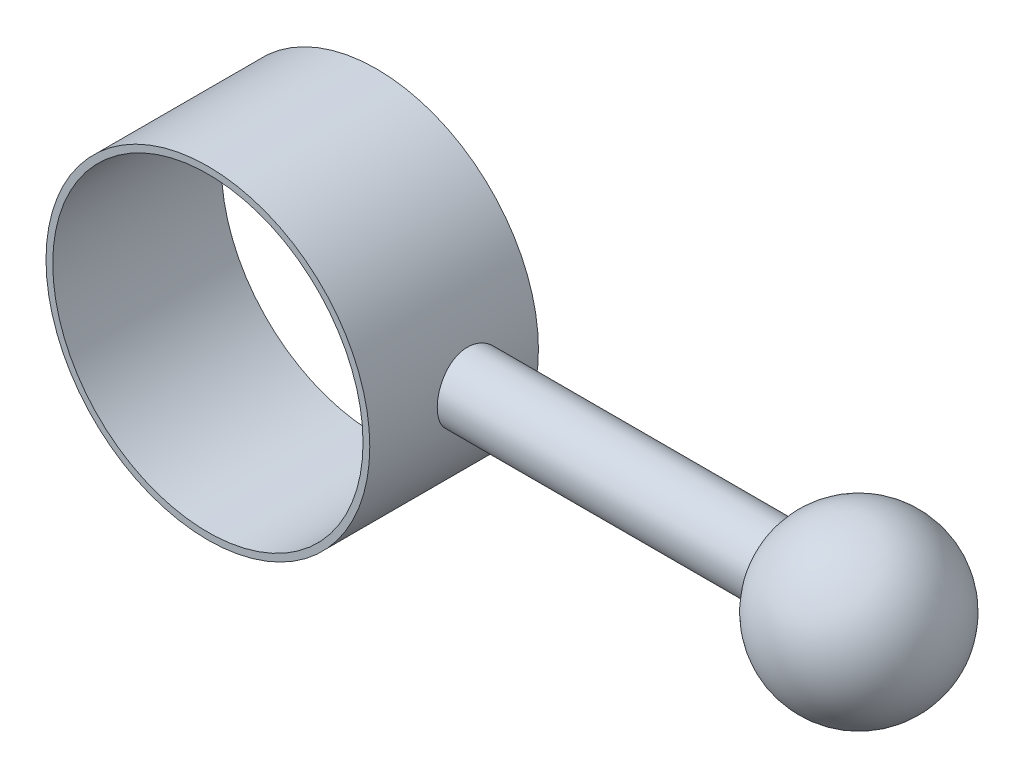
ISO-10303-21;
HEADER;
FILE_DESCRIPTION(('STEP AP214'),'2;1');
FILE_NAME('part.step','',(''),(''),'','','');
FILE_SCHEMA(('AUTOMOTIVE_DESIGN { 1 0 10303 214 1 1 1 1 }'));
ENDSEC;
DATA;
#1=APPLICATION_CONTEXT('core data for automotive mechanical design processes');
#2=APPLICATION_PROTOCOL_DEFINITION('international standard','automotive_design',2000,#1);
#3=PRODUCT_CONTEXT('',#1,'mechanical');
#4=PRODUCT('Part','Part','',(#3));
#5=PRODUCT_RELATED_PRODUCT_CATEGORY('part','',(#4));
#6=PRODUCT_DEFINITION_FORMATION('','',#4);
#7=PRODUCT_DEFINITION_CONTEXT('part definition',#1,'design');
#8=PRODUCT_DEFINITION('design','',#6,#7);
#9=PRODUCT_DEFINITION_SHAPE('','',#8);
#10=(LENGTH_UNIT() NAMED_UNIT(*) SI_UNIT(.MILLI.,.METRE.));
#11=(NAMED_UNIT(*) PLANE_ANGLE_UNIT() SI_UNIT($,.RADIAN.));
#12=(NAMED_UNIT(*) SI_UNIT($,.STERADIAN.) SOLID_ANGLE_UNIT());
#13=UNCERTAINTY_MEASURE_WITH_UNIT(LENGTH_MEASURE(1.E-05),#10,'distance_accuracy_value','');
#14=(GEOMETRIC_REPRESENTATION_CONTEXT(3) GLOBAL_UNCERTAINTY_ASSIGNED_CONTEXT((#13)) GLOBAL_UNIT_ASSIGNED_CONTEXT((#10,
#11,#12)) REPRESENTATION_CONTEXT('',''));
#15=CARTESIAN_POINT('',(0.,0.,0.));
#16=DIRECTION('',(0.,0.,1.));
#17=DIRECTION('',(1.,0.,0.));
#18=AXIS2_PLACEMENT_3D('',#15,#16,#17);
#19=CARTESIAN_POINT('',(0.,0.,25.));
#20=DIRECTION('',(0.,0.,1.));
#21=DIRECTION('',(1.,0.,0.));
#22=AXIS2_PLACEMENT_3D('',#19,#20,#21);
#23=PLANE('',#22);
#24=CARTESIAN_POINT('',(0.,0.,25.));
#25=DIRECTION('',(0.,0.,1.));
#26=DIRECTION('',(1.,0.,0.));
#27=AXIS2_PLACEMENT_3D('',#24,#25,#26);
#28=CIRCLE('',#27,24.);
#29=CARTESIAN_POINT('',(24.,0.,25.));
#30=VERTEX_POINT('',#29);
#31=EDGE_CURVE('E31',#30,#30,#28,.T.);
#32=ORIENTED_EDGE('',*,*,#31,.T.);
#33=EDGE_LOOP('',(#32));
#34=FACE_BOUND('',#33,.T.);
#35=CARTESIAN_POINT('',(0.,0.,25.));
#36=DIRECTION('',(0.,0.,1.));
#37=DIRECTION('',(1.,0.,0.));
#38=AXIS2_PLACEMENT_3D('',#35,#36,#37);
#39=CIRCLE('',#38,23.);
#40=CARTESIAN_POINT('',(23.,0.,25.));
#41=VERTEX_POINT('',#40);
#42=EDGE_CURVE('E39',#41,#41,#39,.T.);
#43=ORIENTED_EDGE('',*,*,#42,.F.);
#44=EDGE_LOOP('',(#43));
#45=FACE_BOUND('',#44,.T.);
#46=ADVANCED_FACE('F12',(#34,#45),#23,.T.);
#47=CARTESIAN_POINT('',(0.,0.,25.));
#48=DIRECTION('',(0.,0.,-1.));
#49=DIRECTION('',(-1.,0.,0.));
#50=AXIS2_PLACEMENT_3D('',#47,#48,#49);
#51=CYLINDRICAL_SURFACE('',#50,24.);
#52=CARTESIAN_POINT('',(0.,0.,0.));
#53=DIRECTION('',(0.,0.,1.));
#54=DIRECTION('',(1.,0.,0.));
#55=AXIS2_PLACEMENT_3D('',#52,#53,#54);
#56=CIRCLE('',#55,24.);
#57=CARTESIAN_POINT('',(24.,0.,0.));
#58=VERTEX_POINT('',#57);
#59=EDGE_CURVE('E36',#58,#58,#56,.T.);
#60=ORIENTED_EDGE('',*,*,#59,.T.);
#61=EDGE_LOOP('',(#60));
#62=FACE_BOUND('',#61,.T.);
#63=ORIENTED_EDGE('',*,*,#31,.F.);
#64=EDGE_LOOP('',(#63));
#65=FACE_BOUND('',#64,.T.);
#66=CARTESIAN_POINT('',(23.473389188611,5.,10.));
#67=CARTESIAN_POINT('',(23.4733947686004,4.99999003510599,9.72243753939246));
#68=CARTESIAN_POINT('',(23.4783658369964,4.97680917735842,9.44475211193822));
#69=CARTESIAN_POINT('',(23.4976806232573,4.88478596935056,8.89725473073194));
#70=CARTESIAN_POINT('',(23.5120315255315,4.81590861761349,8.62744897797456));
#71=CARTESIAN_POINT('',(23.5484117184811,4.63473590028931,8.10371050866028));
#72=CARTESIAN_POINT('',(23.5704330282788,4.52248564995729,7.84976161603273));
#73=CARTESIAN_POINT('',(23.6196632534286,4.25787954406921,7.36430200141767));
#74=CARTESIAN_POINT('',(23.6468719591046,4.10552530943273,7.13279037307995));
#75=CARTESIAN_POINT('',(23.703877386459,3.7625455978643,6.69521849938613));
#76=CARTESIAN_POINT('',(23.7337045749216,3.57142221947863,6.48955242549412));
#77=CARTESIAN_POINT('',(23.792318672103,3.1574048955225,6.11295572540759));
#78=CARTESIAN_POINT('',(23.8211055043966,2.93450862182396,5.94202764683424));
#79=CARTESIAN_POINT('',(23.874725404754,2.46064821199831,5.63821644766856));
#80=CARTESIAN_POINT('',(23.8995183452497,2.20943771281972,5.50570989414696));
#81=CARTESIAN_POINT('',(23.9420138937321,1.68771420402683,5.28493578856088));
#82=CARTESIAN_POINT('',(23.9597172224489,1.41720315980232,5.19666373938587));
#83=CARTESIAN_POINT('',(23.9858235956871,0.868651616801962,5.06809695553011));
#84=CARTESIAN_POINT('',(23.994355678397,0.590773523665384,5.02713593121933));
#85=CARTESIAN_POINT('',(24.0016045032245,0.0319673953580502,4.99227321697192));
#86=CARTESIAN_POINT('',(24.0003222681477,-0.248960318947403,4.99836662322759));
#87=CARTESIAN_POINT('',(23.9881863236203,-0.801306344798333,5.05693840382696));
#88=CARTESIAN_POINT('',(23.977480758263,-1.07280451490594,5.10869887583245));
#89=CARTESIAN_POINT('',(23.9478688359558,-1.60317498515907,5.25599450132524));
#90=CARTESIAN_POINT('',(23.9289621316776,-1.86204675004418,5.35153150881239));
#91=CARTESIAN_POINT('',(23.8848306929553,-2.36184002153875,5.5843202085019));
#92=CARTESIAN_POINT('',(23.8595641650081,-2.60262853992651,5.72184917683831));
#93=CARTESIAN_POINT('',(23.8054920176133,-3.05797382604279,6.03451201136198));
#94=CARTESIAN_POINT('',(23.7766859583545,-3.27252732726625,6.20965055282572));
#95=CARTESIAN_POINT('',(23.7180680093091,-3.67357681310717,6.59648649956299));
#96=CARTESIAN_POINT('',(23.6882473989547,-3.85946594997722,6.80881223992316));
#97=CARTESIAN_POINT('',(23.6314749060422,-4.19310388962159,7.26192819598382));
#98=CARTESIAN_POINT('',(23.6045230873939,-4.34085184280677,7.50271904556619));
#99=CARTESIAN_POINT('',(23.5565199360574,-4.59424868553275,8.00684901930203));
#100=CARTESIAN_POINT('',(23.5354834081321,-4.69979221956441,8.27024260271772));
#101=CARTESIAN_POINT('',(23.5019042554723,-4.86494310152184,8.81156647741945));
#102=CARTESIAN_POINT('',(23.4893604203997,-4.92455699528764,9.08949469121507));
#103=CARTESIAN_POINT('',(23.4744313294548,-4.99523455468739,9.64647882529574));
#104=CARTESIAN_POINT('',(23.471862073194,-5.00717771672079,9.92541833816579));
#105=CARTESIAN_POINT('',(23.47667807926,-4.98454773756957,10.4813032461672));
#106=CARTESIAN_POINT('',(23.4840627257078,-4.94997747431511,10.7582487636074));
#107=CARTESIAN_POINT('',(23.5077815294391,-4.83606233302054,11.2992820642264));
#108=CARTESIAN_POINT('',(23.5240204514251,-4.75719365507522,11.5634746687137));
#109=CARTESIAN_POINT('',(23.5635335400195,-4.55743243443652,12.074895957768));
#110=CARTESIAN_POINT('',(23.5868083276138,-4.43653618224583,12.322123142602));
#111=CARTESIAN_POINT('',(23.6381800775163,-4.15418392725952,12.7964257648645));
#112=CARTESIAN_POINT('',(23.6663402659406,-3.99218130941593,13.0231688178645));
#113=CARTESIAN_POINT('',(23.7241393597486,-3.63293776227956,13.4465729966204));
#114=CARTESIAN_POINT('',(23.7537784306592,-3.43569288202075,13.6432307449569));
#115=CARTESIAN_POINT('',(23.8117969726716,-3.00760180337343,14.0042508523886));
#116=CARTESIAN_POINT('',(23.840146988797,-2.77624763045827,14.1680163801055));
#117=CARTESIAN_POINT('',(23.8918683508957,-2.2888004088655,14.4543550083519));
#118=CARTESIAN_POINT('',(23.9152399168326,-2.03270845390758,14.5769299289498));
#119=CARTESIAN_POINT('',(23.9542459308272,-1.50456847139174,14.7765547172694));
#120=CARTESIAN_POINT('',(23.9699265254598,-1.23262684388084,14.8538766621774));
#121=CARTESIAN_POINT('',(23.9919824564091,-0.679253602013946,14.9616576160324));
#122=CARTESIAN_POINT('',(23.9983590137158,-0.397823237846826,14.9921227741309));
#123=CARTESIAN_POINT('',(24.0010563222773,0.160853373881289,15.0050704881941));
#124=CARTESIAN_POINT('',(23.9975645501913,0.438078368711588,14.988447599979));
#125=CARTESIAN_POINT('',(23.98131496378,0.985691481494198,14.9096774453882));
#126=CARTESIAN_POINT('',(23.9685572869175,1.25607970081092,14.8475308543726));
#127=CARTESIAN_POINT('',(23.9352184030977,1.78172786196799,14.6798888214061));
#128=CARTESIAN_POINT('',(23.9146581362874,2.03702620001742,14.5745093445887));
#129=CARTESIAN_POINT('',(23.867919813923,2.52644226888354,14.3235104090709));
#130=CARTESIAN_POINT('',(23.8417412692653,2.76055815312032,14.1778874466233));
#131=CARTESIAN_POINT('',(23.7860638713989,3.20536128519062,13.847561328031));
#132=CARTESIAN_POINT('',(23.7565152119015,3.41557053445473,13.662222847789));
#133=CARTESIAN_POINT('',(23.6977114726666,3.80221096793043,13.2590219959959));
#134=CARTESIAN_POINT('',(23.6684564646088,3.97863408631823,13.0411518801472));
#135=CARTESIAN_POINT('',(23.6131676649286,4.29469807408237,12.5759635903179));
#136=CARTESIAN_POINT('',(23.5871762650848,4.43387712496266,12.3283263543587));
#137=CARTESIAN_POINT('',(23.541881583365,4.66842511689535,11.8126993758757));
#138=CARTESIAN_POINT('',(23.5225724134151,4.76383265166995,11.544727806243));
#139=CARTESIAN_POINT('',(23.496560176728,4.89026216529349,11.0635748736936));
#140=CARTESIAN_POINT('',(23.4879265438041,4.93133796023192,10.8530818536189));
#141=CARTESIAN_POINT('',(23.4763390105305,4.98621017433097,10.4284168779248));
#142=CARTESIAN_POINT('',(23.4733848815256,5.00000769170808,10.2142450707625));
#143=CARTESIAN_POINT('',(23.473389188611,5.,10.));
#144=B_SPLINE_CURVE_WITH_KNOTS('',3,(#66,#67,#68,#69,#70,#71,#72,#73,#74,#75,#76,#77,#78,#79,
#80,#81,#82,#83,#84,#85,#86,#87,#88,#89,#90,#91,#92,#93,#94,#95,#96,#97,#98,#99,#100,#101,#102,
#103,#104,#105,#106,#107,#108,#109,#110,#111,#112,#113,#114,#115,#116,#117,#118,#119,#120,#121,
#122,#123,#124,#125,#126,#127,#128,#129,#130,#131,#132,#133,#134,#135,#136,#137,#138,#139,#140,
#141,#142,#143),.UNSPECIFIED.,.T.,.F.,(4,2,2,2,2,2,2,2,2,2,2,2,2,2,2,2,2,2,2,2,2,2,2,2,2,2,2,2,
2,2,2,2,2,2,2,2,2,2,4),(0.,0.831902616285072,1.66444316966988,2.49612005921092,3.32776333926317,
4.1708533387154,5.01400514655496,5.86516105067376,6.71623040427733,7.55516195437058,
8.39400607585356,9.21989365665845,10.0458162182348,10.877314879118,11.7089169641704,
12.5562344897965,13.4035708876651,14.2530094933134,15.1023270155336,15.9359006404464,
16.7694226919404,17.5941514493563,18.4189530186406,19.2553567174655,20.0918542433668,
20.9423783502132,21.792864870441,22.6381839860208,23.4833921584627,24.3126517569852,
25.1418990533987,25.9689364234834,26.7960458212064,27.6375327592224,28.4792203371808,
29.3309060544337,30.1818393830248,30.8239947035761,31.4661241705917),.UNSPECIFIED.);
#145=CARTESIAN_POINT('',(23.473389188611,5.,10.));
#146=VERTEX_POINT('',#145);
#147=EDGE_CURVE('E8',#146,#146,#144,.T.);
#148=ORIENTED_EDGE('',*,*,#147,.T.);
#149=EDGE_LOOP('',(#148));
#150=FACE_BOUND('',#149,.T.);
#151=ADVANCED_FACE('F56',(#62,#65,#150),#51,.T.);
#152=CARTESIAN_POINT('',(0.,0.,0.));
#153=DIRECTION('',(0.,0.,1.));
#154=DIRECTION('',(1.,0.,0.));
#155=AXIS2_PLACEMENT_3D('',#152,#153,#154);
#156=PLANE('',#155);
#157=ORIENTED_EDGE('',*,*,#59,.F.);
#158=EDGE_LOOP('',(#157));
#159=FACE_BOUND('',#158,.T.);
#160=CARTESIAN_POINT('',(0.,0.,0.));
#161=DIRECTION('',(0.,0.,1.));
#162=DIRECTION('',(1.,0.,0.));
#163=AXIS2_PLACEMENT_3D('',#160,#161,#162);
#164=CIRCLE('',#163,23.);
#165=CARTESIAN_POINT('',(23.,0.,0.));
#166=VERTEX_POINT('',#165);
#167=EDGE_CURVE('E42',#166,#166,#164,.T.);
#168=ORIENTED_EDGE('',*,*,#167,.T.);
#169=EDGE_LOOP('',(#168));
#170=FACE_BOUND('',#169,.T.);
#171=ADVANCED_FACE('F46',(#159,#170),#156,.F.);
#172=CARTESIAN_POINT('',(0.,0.,25.));
#173=DIRECTION('',(0.,0.,-1.));
#174=DIRECTION('',(-1.,0.,0.));
#175=AXIS2_PLACEMENT_3D('',#172,#173,#174);
#176=CYLINDRICAL_SURFACE('',#175,23.);
#177=ORIENTED_EDGE('',*,*,#167,.F.);
#178=EDGE_LOOP('',(#177));
#179=FACE_BOUND('',#178,.T.);
#180=ORIENTED_EDGE('',*,*,#42,.T.);
#181=EDGE_LOOP('',(#180));
#182=FACE_BOUND('',#181,.T.);
#183=ADVANCED_FACE('F48',(#179,#182),#176,.F.);
#184=CARTESIAN_POINT('',(5.,0.,10.));
#185=DIRECTION('',(1.,0.,0.));
#186=DIRECTION('',(0.,1.,0.));
#187=AXIS2_PLACEMENT_3D('',#184,#185,#186);
#188=CYLINDRICAL_SURFACE('',#187,5.);
#189=CARTESIAN_POINT('',(70.,0.,10.));
#190=DIRECTION('',(-1.,0.,0.));
#191=DIRECTION('',(0.,-1.,0.));
#192=AXIS2_PLACEMENT_3D('',#189,#190,#191);
#193=CIRCLE('',#192,5.);
#194=CARTESIAN_POINT('',(70.,-5.00000000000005,10.));
#195=VERTEX_POINT('',#194);
#196=EDGE_CURVE('E27',#195,#195,#193,.T.);
#197=ORIENTED_EDGE('',*,*,#196,.T.);
#198=EDGE_LOOP('',(#197));
#199=FACE_BOUND('',#198,.T.);
#200=ORIENTED_EDGE('',*,*,#147,.F.);
#201=EDGE_LOOP('',(#200));
#202=FACE_BOUND('',#201,.T.);
#203=ADVANCED_FACE('F51',(#199,#202),#188,.T.);
#204=CARTESIAN_POINT('',(81.5,0.,10.));
#205=DIRECTION('',(0.,-0.998423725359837,0.0561254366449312));
#206=DIRECTION('',(0.,-0.0561254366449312,-0.998423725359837));
#207=AXIS2_PLACEMENT_3D('',#204,#205,#206);
#208=SPHERICAL_SURFACE('',#207,12.5000001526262);
#209=CARTESIAN_POINT('',(81.5,0.,10.));
#210=DIRECTION('',(-1.,0.,0.));
#211=DIRECTION('',(0.,0.998423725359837,-0.0561254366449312));
#212=AXIS2_PLACEMENT_3D('',#209,#210,#211);
#213=SPHERICAL_SURFACE('',#212,12.5000001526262);
#214=CARTESIAN_POINT('',(70.,0.,10.));
#215=DIRECTION('',(-1.,0.,0.));
#216=DIRECTION('',(0.,0.998423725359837,-0.0561254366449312));
#217=AXIS2_PLACEMENT_3D('',#214,#215,#216);
#218=CIRCLE('',#217,4.89898);
#219=CARTESIAN_POINT('',(70.,4.89125786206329,9.72504260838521));
#220=VERTEX_POINT('',#219);
#221=EDGE_CURVE('E23',#220,#220,#218,.T.);
#222=ORIENTED_EDGE('',*,*,#221,.F.);
#223=EDGE_LOOP('',(#222));
#224=FACE_BOUND('',#223,.T.);
#225=ADVANCED_FACE('F14',(#224),#213,.T.);
#226=CARTESIAN_POINT('',(70.,0.,10.));
#227=DIRECTION('',(-1.,0.,0.));
#228=DIRECTION('',(0.,-1.,0.));
#229=AXIS2_PLACEMENT_3D('',#226,#227,#228);
#230=PLANE('',#229);
#231=ORIENTED_EDGE('',*,*,#196,.F.);
#232=EDGE_LOOP('',(#231));
#233=FACE_BOUND('',#232,.T.);
#234=ORIENTED_EDGE('',*,*,#221,.T.);
#235=EDGE_LOOP('',(#234));
#236=FACE_BOUND('',#235,.T.);
#237=ADVANCED_FACE('F68',(#233,#236),#230,.F.);
#238=CLOSED_SHELL('',(#46,#151,#171,#183,#203,#225,#237));
#239=MANIFOLD_SOLID_BREP('B1',#238);
#240=ADVANCED_BREP_SHAPE_REPRESENTATION('',(#18,#239),#14);
#241=SHAPE_DEFINITION_REPRESENTATION(#9,#240);
ENDSEC;
END-ISO-10303-21;
